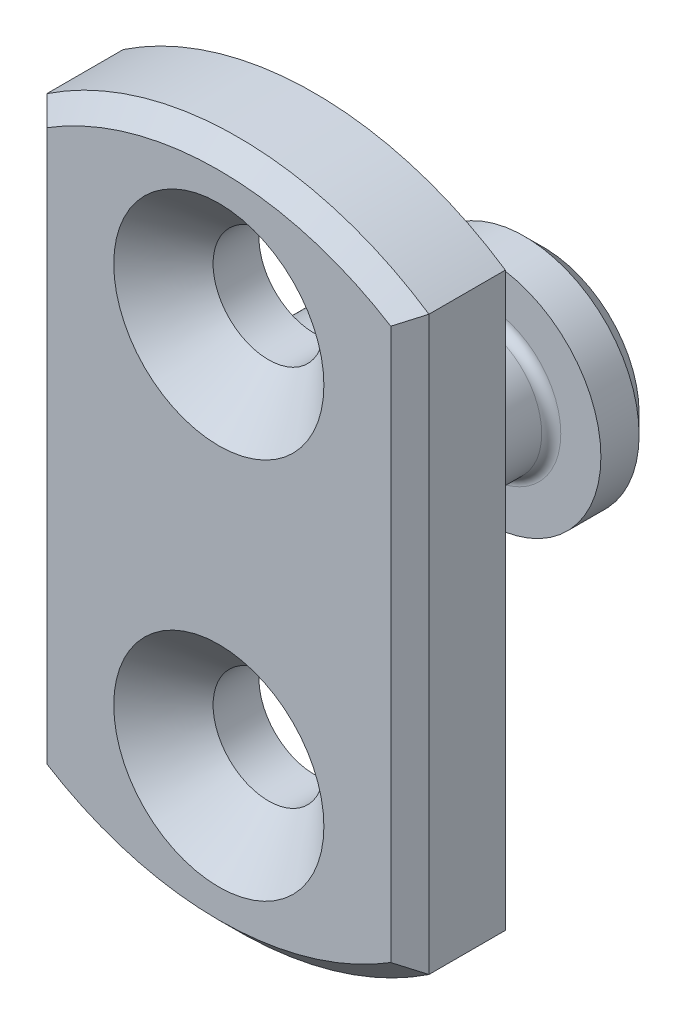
ISO-10303-21;
HEADER;
FILE_DESCRIPTION(('STEP AP214'),'2;1');
FILE_NAME('part.step','',(''),(''),'','','');
FILE_SCHEMA(('AUTOMOTIVE_DESIGN { 1 0 10303 214 1 1 1 1 }'));
ENDSEC;
DATA;
#1=APPLICATION_CONTEXT('core data for automotive mechanical design processes');
#2=APPLICATION_PROTOCOL_DEFINITION('international standard','automotive_design',2000,#1);
#3=PRODUCT_CONTEXT('',#1,'mechanical');
#4=PRODUCT('Part','Part','',(#3));
#5=PRODUCT_RELATED_PRODUCT_CATEGORY('part','',(#4));
#6=PRODUCT_DEFINITION_FORMATION('','',#4);
#7=PRODUCT_DEFINITION_CONTEXT('part definition',#1,'design');
#8=PRODUCT_DEFINITION('design','',#6,#7);
#9=PRODUCT_DEFINITION_SHAPE('','',#8);
#10=(LENGTH_UNIT() NAMED_UNIT(*) SI_UNIT(.MILLI.,.METRE.));
#11=(NAMED_UNIT(*) PLANE_ANGLE_UNIT() SI_UNIT($,.RADIAN.));
#12=(NAMED_UNIT(*) SI_UNIT($,.STERADIAN.) SOLID_ANGLE_UNIT());
#13=UNCERTAINTY_MEASURE_WITH_UNIT(LENGTH_MEASURE(1.E-05),#10,'distance_accuracy_value','');
#14=(GEOMETRIC_REPRESENTATION_CONTEXT(3) GLOBAL_UNCERTAINTY_ASSIGNED_CONTEXT((#13)) GLOBAL_UNIT_ASSIGNED_CONTEXT((#10,
#11,#12)) REPRESENTATION_CONTEXT('',''));
#15=CARTESIAN_POINT('',(0.,0.,0.));
#16=DIRECTION('',(0.,0.,1.));
#17=DIRECTION('',(1.,0.,0.));
#18=AXIS2_PLACEMENT_3D('',#15,#16,#17);
#19=CARTESIAN_POINT('',(0.,0.,8.5));
#20=DIRECTION('',(0.,0.,-1.));
#21=DIRECTION('',(-1.,0.,0.));
#22=AXIS2_PLACEMENT_3D('',#19,#20,#21);
#23=CYLINDRICAL_SURFACE('',#22,9.);
#24=DIRECTION('',(0.,0.,-1.));
#25=VECTOR('',#24,1.);
#26=CARTESIAN_POINT('',(-5.,7.48331477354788,8.5));
#27=LINE('',#26,#25);
#28=CARTESIAN_POINT('',(-5.,7.48331477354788,8.00000000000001));
#29=VERTEX_POINT('',#28);
#30=CARTESIAN_POINT('',(-5.,7.48331477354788,6.));
#31=VERTEX_POINT('',#30);
#32=EDGE_CURVE('E118',#29,#31,#27,.T.);
#33=ORIENTED_EDGE('',*,*,#32,.F.);
#34=CARTESIAN_POINT('',(0.,0.,8.00000000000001));
#35=DIRECTION('',(0.,0.,1.));
#36=DIRECTION('',(1.,0.,0.));
#37=AXIS2_PLACEMENT_3D('',#34,#35,#36);
#38=CIRCLE('',#37,9.);
#39=CARTESIAN_POINT('',(5.,7.48331477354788,8.00000000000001));
#40=VERTEX_POINT('',#39);
#41=EDGE_CURVE('E13',#29,#40,#38,.F.);
#42=ORIENTED_EDGE('',*,*,#41,.T.);
#43=DIRECTION('',(0.,0.,-1.));
#44=VECTOR('',#43,1.);
#45=CARTESIAN_POINT('',(5.,7.48331477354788,8.5));
#46=LINE('',#45,#44);
#47=CARTESIAN_POINT('',(5.,7.48331477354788,6.));
#48=VERTEX_POINT('',#47);
#49=EDGE_CURVE('E148',#40,#48,#46,.T.);
#50=ORIENTED_EDGE('',*,*,#49,.T.);
#51=CARTESIAN_POINT('',(0.,0.,6.));
#52=DIRECTION('',(0.,0.,1.));
#53=DIRECTION('',(1.,0.,0.));
#54=AXIS2_PLACEMENT_3D('',#51,#52,#53);
#55=CIRCLE('',#54,9.);
#56=EDGE_CURVE('E139',#48,#31,#55,.T.);
#57=ORIENTED_EDGE('',*,*,#56,.T.);
#58=EDGE_LOOP('',(#33,#42,#50,#57));
#59=FACE_BOUND('',#58,.T.);
#60=ADVANCED_FACE('F59',(#59),#23,.T.);
#61=DIRECTION('',(0.,0.,-1.));
#62=VECTOR('',#61,1.);
#63=CARTESIAN_POINT('',(5.,-7.48331477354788,8.5));
#64=LINE('',#63,#62);
#65=CARTESIAN_POINT('',(5.,-7.48331477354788,6.));
#66=VERTEX_POINT('',#65);
#67=CARTESIAN_POINT('',(5.,-7.48331477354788,8.00000000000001));
#68=VERTEX_POINT('',#67);
#69=EDGE_CURVE('E303',#66,#68,#64,.F.);
#70=ORIENTED_EDGE('',*,*,#69,.T.);
#71=CARTESIAN_POINT('',(0.,0.,8.00000000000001));
#72=DIRECTION('',(0.,0.,1.));
#73=DIRECTION('',(1.,0.,0.));
#74=AXIS2_PLACEMENT_3D('',#71,#72,#73);
#75=CIRCLE('',#74,9.);
#76=CARTESIAN_POINT('',(-5.,-7.48331477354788,8.00000000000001));
#77=VERTEX_POINT('',#76);
#78=EDGE_CURVE('E133',#68,#77,#75,.F.);
#79=ORIENTED_EDGE('',*,*,#78,.T.);
#80=DIRECTION('',(0.,0.,-1.));
#81=VECTOR('',#80,1.);
#82=CARTESIAN_POINT('',(-5.,-7.48331477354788,8.5));
#83=LINE('',#82,#81);
#84=CARTESIAN_POINT('',(-5.,-7.48331477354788,6.));
#85=VERTEX_POINT('',#84);
#86=EDGE_CURVE('E117',#85,#77,#83,.F.);
#87=ORIENTED_EDGE('',*,*,#86,.F.);
#88=EDGE_CURVE('E131',#85,#66,#55,.T.);
#89=ORIENTED_EDGE('',*,*,#88,.T.);
#90=EDGE_LOOP('',(#70,#79,#87,#89));
#91=FACE_BOUND('',#90,.T.);
#92=ADVANCED_FACE('F130',(#91),#23,.T.);
#93=CARTESIAN_POINT('',(0.,0.,8.5));
#94=DIRECTION('',(0.,0.,1.));
#95=DIRECTION('',(1.,0.,0.));
#96=AXIS2_PLACEMENT_3D('',#93,#94,#95);
#97=PLANE('',#96);
#98=DIRECTION('',(0.,-1.,0.));
#99=VECTOR('',#98,1.);
#100=CARTESIAN_POINT('',(-4.5,0.,8.5));
#101=LINE('',#100,#99);
#102=CARTESIAN_POINT('',(-4.5,7.21110255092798,8.5));
#103=VERTEX_POINT('',#102);
#104=CARTESIAN_POINT('',(-4.5,-7.21110255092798,8.5));
#105=VERTEX_POINT('',#104);
#106=EDGE_CURVE('E182',#103,#105,#101,.T.);
#107=ORIENTED_EDGE('',*,*,#106,.T.);
#108=CARTESIAN_POINT('',(0.,0.,8.5));
#109=DIRECTION('',(0.,0.,1.));
#110=DIRECTION('',(1.,0.,0.));
#111=AXIS2_PLACEMENT_3D('',#108,#109,#110);
#112=CIRCLE('',#111,8.5);
#113=CARTESIAN_POINT('',(4.50000000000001,-7.21110255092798,8.5));
#114=VERTEX_POINT('',#113);
#115=EDGE_CURVE('E186',#105,#114,#112,.T.);
#116=ORIENTED_EDGE('',*,*,#115,.T.);
#117=DIRECTION('',(0.,1.,0.));
#118=VECTOR('',#117,1.);
#119=CARTESIAN_POINT('',(4.5,7.48331477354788,8.5));
#120=LINE('',#119,#118);
#121=CARTESIAN_POINT('',(4.5,7.21110255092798,8.5));
#122=VERTEX_POINT('',#121);
#123=EDGE_CURVE('E184',#114,#122,#120,.T.);
#124=ORIENTED_EDGE('',*,*,#123,.T.);
#125=CARTESIAN_POINT('',(0.,0.,8.5));
#126=DIRECTION('',(0.,0.,1.));
#127=DIRECTION('',(1.,0.,0.));
#128=AXIS2_PLACEMENT_3D('',#125,#126,#127);
#129=CIRCLE('',#128,8.5);
#130=EDGE_CURVE('E172',#122,#103,#129,.T.);
#131=ORIENTED_EDGE('',*,*,#130,.T.);
#132=EDGE_LOOP('',(#107,#116,#124,#131));
#133=FACE_BOUND('',#132,.T.);
#134=CARTESIAN_POINT('',(0.,-5.,8.5));
#135=DIRECTION('',(0.,0.,1.));
#136=DIRECTION('',(1.,0.,0.));
#137=AXIS2_PLACEMENT_3D('',#134,#135,#136);
#138=CIRCLE('',#137,2.75);
#139=CARTESIAN_POINT('',(2.75,-5.,8.5));
#140=VERTEX_POINT('',#139);
#141=EDGE_CURVE('E293',#140,#140,#138,.T.);
#142=ORIENTED_EDGE('',*,*,#141,.F.);
#143=EDGE_LOOP('',(#142));
#144=FACE_BOUND('',#143,.T.);
#145=CARTESIAN_POINT('',(0.,5.,8.5));
#146=DIRECTION('',(0.,0.,1.));
#147=DIRECTION('',(1.,0.,0.));
#148=AXIS2_PLACEMENT_3D('',#145,#146,#147);
#149=CIRCLE('',#148,2.75);
#150=CARTESIAN_POINT('',(2.75,5.,8.5));
#151=VERTEX_POINT('',#150);
#152=EDGE_CURVE('E179',#151,#151,#149,.T.);
#153=ORIENTED_EDGE('',*,*,#152,.F.);
#154=EDGE_LOOP('',(#153));
#155=FACE_BOUND('',#154,.T.);
#156=ADVANCED_FACE('F230',(#133,#144,#155),#97,.T.);
#157=CARTESIAN_POINT('',(0.,0.,6.));
#158=DIRECTION('',(0.,0.,1.));
#159=DIRECTION('',(1.,0.,0.));
#160=AXIS2_PLACEMENT_3D('',#157,#158,#159);
#161=PLANE('',#160);
#162=CARTESIAN_POINT('',(0.,-5.,6.));
#163=DIRECTION('',(0.,0.,1.));
#164=DIRECTION('',(1.,0.,0.));
#165=AXIS2_PLACEMENT_3D('',#162,#163,#164);
#166=CIRCLE('',#165,1.45);
#167=CARTESIAN_POINT('',(1.45,-5.,6.));
#168=VERTEX_POINT('',#167);
#169=EDGE_CURVE('E176',#168,#168,#166,.T.);
#170=ORIENTED_EDGE('',*,*,#169,.T.);
#171=EDGE_LOOP('',(#170));
#172=FACE_BOUND('',#171,.T.);
#173=CARTESIAN_POINT('',(0.,5.,6.));
#174=DIRECTION('',(0.,0.,1.));
#175=DIRECTION('',(1.,0.,0.));
#176=AXIS2_PLACEMENT_3D('',#173,#174,#175);
#177=CIRCLE('',#176,1.45);
#178=CARTESIAN_POINT('',(1.45,5.,6.));
#179=VERTEX_POINT('',#178);
#180=EDGE_CURVE('E134',#179,#179,#177,.T.);
#181=ORIENTED_EDGE('',*,*,#180,.T.);
#182=EDGE_LOOP('',(#181));
#183=FACE_BOUND('',#182,.T.);
#184=CARTESIAN_POINT('',(0.,0.,6.));
#185=DIRECTION('',(0.,0.,1.));
#186=DIRECTION('',(1.,0.,0.));
#187=AXIS2_PLACEMENT_3D('',#184,#185,#186);
#188=CIRCLE('',#187,3.);
#189=CARTESIAN_POINT('',(3.,0.,6.));
#190=VERTEX_POINT('',#189);
#191=EDGE_CURVE('E142',#190,#190,#188,.T.);
#192=ORIENTED_EDGE('',*,*,#191,.T.);
#193=EDGE_LOOP('',(#192));
#194=FACE_BOUND('',#193,.T.);
#195=ORIENTED_EDGE('',*,*,#56,.F.);
#196=DIRECTION('',(0.,-1.,0.));
#197=VECTOR('',#196,1.);
#198=CARTESIAN_POINT('',(5.,0.,6.));
#199=LINE('',#198,#197);
#200=EDGE_CURVE('E123',#48,#66,#199,.T.);
#201=ORIENTED_EDGE('',*,*,#200,.T.);
#202=ORIENTED_EDGE('',*,*,#88,.F.);
#203=DIRECTION('',(0.,-1.,0.));
#204=VECTOR('',#203,1.);
#205=CARTESIAN_POINT('',(-5.,0.,6.));
#206=LINE('',#205,#204);
#207=EDGE_CURVE('E114',#31,#85,#206,.T.);
#208=ORIENTED_EDGE('',*,*,#207,.F.);
#209=EDGE_LOOP('',(#195,#201,#202,#208));
#210=FACE_BOUND('',#209,.T.);
#211=ADVANCED_FACE('F137',(#172,#183,#194,#210),#161,.F.);
#212=CARTESIAN_POINT('',(0.,0.,6.));
#213=DIRECTION('',(0.,0.,-1.));
#214=DIRECTION('',(-1.,0.,0.));
#215=AXIS2_PLACEMENT_3D('',#212,#213,#214);
#216=CYLINDRICAL_SURFACE('',#215,3.);
#217=ORIENTED_EDGE('',*,*,#191,.F.);
#218=EDGE_LOOP('',(#217));
#219=FACE_BOUND('',#218,.T.);
#220=CARTESIAN_POINT('',(0.,0.,4.));
#221=DIRECTION('',(0.,0.,-1.));
#222=DIRECTION('',(-1.,0.,0.));
#223=AXIS2_PLACEMENT_3D('',#220,#221,#222);
#224=CIRCLE('',#223,3.);
#225=CARTESIAN_POINT('',(-3.,0.,4.));
#226=VERTEX_POINT('',#225);
#227=EDGE_CURVE('E140',#226,#226,#224,.T.);
#228=ORIENTED_EDGE('',*,*,#227,.F.);
#229=EDGE_LOOP('',(#228));
#230=FACE_BOUND('',#229,.T.);
#231=ADVANCED_FACE('F240',(#219,#230),#216,.T.);
#232=CARTESIAN_POINT('',(1.7,0.,4.));
#233=DIRECTION('',(0.,0.,-1.));
#234=DIRECTION('',(-1.,0.,0.));
#235=AXIS2_PLACEMENT_3D('',#232,#233,#234);
#236=PLANE('',#235);
#237=CARTESIAN_POINT('',(0.,0.,4.));
#238=DIRECTION('',(0.,0.,-1.));
#239=DIRECTION('',(-1.,0.,0.));
#240=AXIS2_PLACEMENT_3D('',#237,#238,#239);
#241=CIRCLE('',#240,1.95);
#242=CARTESIAN_POINT('',(-1.95,0.,4.));
#243=VERTEX_POINT('',#242);
#244=EDGE_CURVE('E163',#243,#243,#241,.F.);
#245=ORIENTED_EDGE('',*,*,#244,.T.);
#246=EDGE_LOOP('',(#245));
#247=FACE_BOUND('',#246,.T.);
#248=ORIENTED_EDGE('',*,*,#227,.T.);
#249=EDGE_LOOP('',(#248));
#250=FACE_BOUND('',#249,.T.);
#251=ADVANCED_FACE('F243',(#247,#250),#236,.T.);
#252=CARTESIAN_POINT('',(1.7,0.,1.5));
#253=DIRECTION('',(0.,0.,1.));
#254=DIRECTION('',(1.,0.,0.));
#255=AXIS2_PLACEMENT_3D('',#252,#253,#254);
#256=PLANE('',#255);
#257=CARTESIAN_POINT('',(0.,0.,1.5));
#258=DIRECTION('',(0.,0.,1.));
#259=DIRECTION('',(1.,0.,0.));
#260=AXIS2_PLACEMENT_3D('',#257,#258,#259);
#261=CIRCLE('',#260,1.95);
#262=CARTESIAN_POINT('',(1.95,0.,1.5));
#263=VERTEX_POINT('',#262);
#264=EDGE_CURVE('E152',#263,#263,#261,.F.);
#265=ORIENTED_EDGE('',*,*,#264,.T.);
#266=EDGE_LOOP('',(#265));
#267=FACE_BOUND('',#266,.T.);
#268=CARTESIAN_POINT('',(0.,0.,1.5));
#269=DIRECTION('',(0.,0.,1.));
#270=DIRECTION('',(1.,0.,0.));
#271=AXIS2_PLACEMENT_3D('',#268,#269,#270);
#272=CIRCLE('',#271,3.);
#273=CARTESIAN_POINT('',(3.,0.,1.5));
#274=VERTEX_POINT('',#273);
#275=EDGE_CURVE('E144',#274,#274,#272,.T.);
#276=ORIENTED_EDGE('',*,*,#275,.T.);
#277=EDGE_LOOP('',(#276));
#278=FACE_BOUND('',#277,.T.);
#279=ADVANCED_FACE('F268',(#267,#278),#256,.T.);
#280=CARTESIAN_POINT('',(0.,0.,-0.389556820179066));
#281=DIRECTION('',(0.,0.,-1.));
#282=DIRECTION('',(-1.,0.,0.));
#283=AXIS2_PLACEMENT_3D('',#280,#281,#282);
#284=CYLINDRICAL_SURFACE('',#283,1.7);
#285=CARTESIAN_POINT('',(0.,0.,1.75));
#286=DIRECTION('',(0.,0.,1.));
#287=DIRECTION('',(1.,0.,0.));
#288=AXIS2_PLACEMENT_3D('',#285,#286,#287);
#289=CIRCLE('',#288,1.7);
#290=CARTESIAN_POINT('',(1.7,0.,1.75));
#291=VERTEX_POINT('',#290);
#292=EDGE_CURVE('E160',#291,#291,#289,.T.);
#293=ORIENTED_EDGE('',*,*,#292,.T.);
#294=EDGE_LOOP('',(#293));
#295=FACE_BOUND('',#294,.T.);
#296=CARTESIAN_POINT('',(0.,0.,3.75));
#297=DIRECTION('',(0.,0.,-1.));
#298=DIRECTION('',(-1.,0.,0.));
#299=AXIS2_PLACEMENT_3D('',#296,#297,#298);
#300=CIRCLE('',#299,1.7);
#301=CARTESIAN_POINT('',(-1.7,0.,3.75));
#302=VERTEX_POINT('',#301);
#303=EDGE_CURVE('E157',#302,#302,#300,.T.);
#304=ORIENTED_EDGE('',*,*,#303,.T.);
#305=EDGE_LOOP('',(#304));
#306=FACE_BOUND('',#305,.T.);
#307=ADVANCED_FACE('F238',(#295,#306),#284,.T.);
#308=CARTESIAN_POINT('',(0.,0.,0.));
#309=DIRECTION('',(0.,0.,1.));
#310=DIRECTION('',(1.,0.,0.));
#311=AXIS2_PLACEMENT_3D('',#308,#309,#310);
#312=PLANE('',#311);
#313=CARTESIAN_POINT('',(0.,0.,0.));
#314=DIRECTION('',(0.,0.,1.));
#315=DIRECTION('',(1.,0.,0.));
#316=AXIS2_PLACEMENT_3D('',#313,#314,#315);
#317=CIRCLE('',#316,2.5);
#318=CARTESIAN_POINT('',(2.5,0.,0.));
#319=VERTEX_POINT('',#318);
#320=EDGE_CURVE('E124',#319,#319,#317,.F.);
#321=ORIENTED_EDGE('',*,*,#320,.T.);
#322=EDGE_LOOP('',(#321));
#323=FACE_BOUND('',#322,.T.);
#324=ADVANCED_FACE('F234',(#323),#312,.F.);
#325=CARTESIAN_POINT('',(0.,0.,0.500000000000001));
#326=DIRECTION('',(0.,0.,1.));
#327=DIRECTION('',(1.,0.,0.));
#328=AXIS2_PLACEMENT_3D('',#325,#326,#327);
#329=CIRCLE('',#328,3.);
#330=CARTESIAN_POINT('',(3.,0.,0.500000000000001));
#331=VERTEX_POINT('',#330);
#332=EDGE_CURVE('E166',#331,#331,#329,.T.);
#333=ORIENTED_EDGE('',*,*,#332,.T.);
#334=EDGE_LOOP('',(#333));
#335=FACE_BOUND('',#334,.T.);
#336=ORIENTED_EDGE('',*,*,#275,.F.);
#337=EDGE_LOOP('',(#336));
#338=FACE_BOUND('',#337,.T.);
#339=ADVANCED_FACE('F237',(#335,#338),#216,.T.);
#340=CARTESIAN_POINT('',(0.,0.,1.75));
#341=DIRECTION('',(0.,0.,1.));
#342=DIRECTION('',(1.,0.,0.));
#343=AXIS2_PLACEMENT_3D('',#340,#341,#342);
#344=TOROIDAL_SURFACE('',#343,1.95,0.25);
#345=ORIENTED_EDGE('',*,*,#292,.F.);
#346=EDGE_LOOP('',(#345));
#347=FACE_BOUND('',#346,.T.);
#348=ORIENTED_EDGE('',*,*,#264,.F.);
#349=EDGE_LOOP('',(#348));
#350=FACE_BOUND('',#349,.T.);
#351=ADVANCED_FACE('F245',(#347,#350),#344,.F.);
#352=CARTESIAN_POINT('',(0.,0.,3.75));
#353=DIRECTION('',(0.,0.,-1.));
#354=DIRECTION('',(-1.,0.,0.));
#355=AXIS2_PLACEMENT_3D('',#352,#353,#354);
#356=TOROIDAL_SURFACE('',#355,1.95,0.25);
#357=ORIENTED_EDGE('',*,*,#244,.F.);
#358=EDGE_LOOP('',(#357));
#359=FACE_BOUND('',#358,.T.);
#360=ORIENTED_EDGE('',*,*,#303,.F.);
#361=EDGE_LOOP('',(#360));
#362=FACE_BOUND('',#361,.T.);
#363=ADVANCED_FACE('F248',(#359,#362),#356,.F.);
#364=CARTESIAN_POINT('',(0.,0.,0.500000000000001));
#365=DIRECTION('',(0.,0.,1.));
#366=DIRECTION('',(1.,0.,0.));
#367=AXIS2_PLACEMENT_3D('',#364,#365,#366);
#368=CONICAL_SURFACE('',#367,3.,0.785398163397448);
#369=ORIENTED_EDGE('',*,*,#320,.F.);
#370=EDGE_LOOP('',(#369));
#371=FACE_BOUND('',#370,.T.);
#372=ORIENTED_EDGE('',*,*,#332,.F.);
#373=EDGE_LOOP('',(#372));
#374=FACE_BOUND('',#373,.T.);
#375=ADVANCED_FACE('F251',(#371,#374),#368,.T.);
#376=CARTESIAN_POINT('',(-5.,13.7579719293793,0.));
#377=DIRECTION('',(-1.,0.,0.));
#378=DIRECTION('',(0.,-1.,0.));
#379=AXIS2_PLACEMENT_3D('',#376,#377,#378);
#380=PLANE('',#379);
#381=ORIENTED_EDGE('',*,*,#86,.T.);
#382=DIRECTION('',(0.,1.,0.));
#383=VECTOR('',#382,1.);
#384=CARTESIAN_POINT('',(-5.,13.7579719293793,8.00000000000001));
#385=LINE('',#384,#383);
#386=EDGE_CURVE('E72',#77,#29,#385,.T.);
#387=ORIENTED_EDGE('',*,*,#386,.T.);
#388=ORIENTED_EDGE('',*,*,#32,.T.);
#389=ORIENTED_EDGE('',*,*,#207,.T.);
#390=EDGE_LOOP('',(#381,#387,#388,#389));
#391=FACE_BOUND('',#390,.T.);
#392=ADVANCED_FACE('F116',(#391),#380,.T.);
#393=CARTESIAN_POINT('',(5.,13.7579719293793,0.));
#394=DIRECTION('',(-1.,0.,0.));
#395=DIRECTION('',(0.,-1.,0.));
#396=AXIS2_PLACEMENT_3D('',#393,#394,#395);
#397=PLANE('',#396);
#398=ORIENTED_EDGE('',*,*,#49,.F.);
#399=DIRECTION('',(0.,-1.,0.));
#400=VECTOR('',#399,1.);
#401=CARTESIAN_POINT('',(5.,-7.48331477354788,8.00000000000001));
#402=LINE('',#401,#400);
#403=EDGE_CURVE('E190',#40,#68,#402,.T.);
#404=ORIENTED_EDGE('',*,*,#403,.T.);
#405=ORIENTED_EDGE('',*,*,#69,.F.);
#406=ORIENTED_EDGE('',*,*,#200,.F.);
#407=EDGE_LOOP('',(#398,#404,#405,#406));
#408=FACE_BOUND('',#407,.T.);
#409=ADVANCED_FACE('F258',(#408),#397,.F.);
#410=CARTESIAN_POINT('',(0.,5.,8.5));
#411=DIRECTION('',(0.,0.,1.));
#412=DIRECTION('',(1.,0.,0.));
#413=AXIS2_PLACEMENT_3D('',#410,#411,#412);
#414=CYLINDRICAL_SURFACE('',#413,1.45);
#415=CARTESIAN_POINT('',(0.,5.,7.2));
#416=DIRECTION('',(0.,0.,1.));
#417=DIRECTION('',(1.,0.,0.));
#418=AXIS2_PLACEMENT_3D('',#415,#416,#417);
#419=CIRCLE('',#418,1.45);
#420=CARTESIAN_POINT('',(1.45,5.,7.2));
#421=VERTEX_POINT('',#420);
#422=EDGE_CURVE('E175',#421,#421,#419,.T.);
#423=ORIENTED_EDGE('',*,*,#422,.T.);
#424=EDGE_LOOP('',(#423));
#425=FACE_BOUND('',#424,.T.);
#426=ORIENTED_EDGE('',*,*,#180,.F.);
#427=EDGE_LOOP('',(#426));
#428=FACE_BOUND('',#427,.T.);
#429=ADVANCED_FACE('F334',(#425,#428),#414,.F.);
#430=CARTESIAN_POINT('',(0.,5.,8.5));
#431=DIRECTION('',(0.,0.,1.));
#432=DIRECTION('',(1.,0.,0.));
#433=AXIS2_PLACEMENT_3D('',#430,#431,#432);
#434=CONICAL_SURFACE('',#433,2.75,0.785398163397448);
#435=ORIENTED_EDGE('',*,*,#422,.F.);
#436=EDGE_LOOP('',(#435));
#437=FACE_BOUND('',#436,.T.);
#438=ORIENTED_EDGE('',*,*,#152,.T.);
#439=EDGE_LOOP('',(#438));
#440=FACE_BOUND('',#439,.T.);
#441=ADVANCED_FACE('F329',(#437,#440),#434,.F.);
#442=CARTESIAN_POINT('',(0.,-5.,8.5));
#443=DIRECTION('',(0.,0.,1.));
#444=DIRECTION('',(1.,0.,0.));
#445=AXIS2_PLACEMENT_3D('',#442,#443,#444);
#446=CYLINDRICAL_SURFACE('',#445,1.45);
#447=CARTESIAN_POINT('',(0.,-5.,7.2));
#448=DIRECTION('',(0.,0.,1.));
#449=DIRECTION('',(1.,0.,0.));
#450=AXIS2_PLACEMENT_3D('',#447,#448,#449);
#451=CIRCLE('',#450,1.45);
#452=CARTESIAN_POINT('',(1.45,-5.,7.2));
#453=VERTEX_POINT('',#452);
#454=EDGE_CURVE('E180',#453,#453,#451,.T.);
#455=ORIENTED_EDGE('',*,*,#454,.T.);
#456=EDGE_LOOP('',(#455));
#457=FACE_BOUND('',#456,.T.);
#458=ORIENTED_EDGE('',*,*,#169,.F.);
#459=EDGE_LOOP('',(#458));
#460=FACE_BOUND('',#459,.T.);
#461=ADVANCED_FACE('F321',(#457,#460),#446,.F.);
#462=CARTESIAN_POINT('',(0.,-5.,8.5));
#463=DIRECTION('',(0.,0.,1.));
#464=DIRECTION('',(1.,0.,0.));
#465=AXIS2_PLACEMENT_3D('',#462,#463,#464);
#466=CONICAL_SURFACE('',#465,2.75,0.785398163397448);
#467=ORIENTED_EDGE('',*,*,#454,.F.);
#468=EDGE_LOOP('',(#467));
#469=FACE_BOUND('',#468,.T.);
#470=ORIENTED_EDGE('',*,*,#141,.T.);
#471=EDGE_LOOP('',(#470));
#472=FACE_BOUND('',#471,.T.);
#473=ADVANCED_FACE('F222',(#469,#472),#466,.F.);
#474=CARTESIAN_POINT('',(0.,0.,8.5));
#475=DIRECTION('',(0.,0.,-1.));
#476=DIRECTION('',(-1.,0.,0.));
#477=AXIS2_PLACEMENT_3D('',#474,#475,#476);
#478=CONICAL_SURFACE('',#477,8.5,0.785398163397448);
#479=CARTESIAN_POINT('',(4.5,7.21110255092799,8.5));
#480=CARTESIAN_POINT('',(4.58313411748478,7.25720319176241,8.41686588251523));
#481=CARTESIAN_POINT('',(4.66636785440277,7.30293787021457,8.33363214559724));
#482=CARTESIAN_POINT('',(4.83303452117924,7.39367527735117,8.16696547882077));
#483=CARTESIAN_POINT('',(4.91646745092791,7.43867800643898,8.0835325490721));
#484=CARTESIAN_POINT('',(4.99999999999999,7.4833147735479,8.00000000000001));
#485=B_SPLINE_CURVE_WITH_KNOTS('',3,(#479,#480,#481,#482,#483,#484),.UNSPECIFIED.,.F.,.F.,(4,2,
4),(0.,0.37884869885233,0.757697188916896),.UNSPECIFIED.);
#486=EDGE_CURVE('E310',#40,#122,#485,.F.);
#487=ORIENTED_EDGE('',*,*,#486,.F.);
#488=ORIENTED_EDGE('',*,*,#41,.F.);
#489=CARTESIAN_POINT('',(-5.,7.48331477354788,8.00000000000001));
#490=CARTESIAN_POINT('',(-4.91646745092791,7.43867800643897,8.08353254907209));
#491=CARTESIAN_POINT('',(-4.83303452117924,7.39367527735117,8.16696547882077));
#492=CARTESIAN_POINT('',(-4.66636785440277,7.30293787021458,8.33363214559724));
#493=CARTESIAN_POINT('',(-4.58313411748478,7.25720319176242,8.41686588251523));
#494=CARTESIAN_POINT('',(-4.5,7.211102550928,8.5));
#495=B_SPLINE_CURVE_WITH_KNOTS('',3,(#489,#490,#491,#492,#493,#494),.UNSPECIFIED.,.F.,.F.,(4,2,
4),(0.,0.378848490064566,0.757697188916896),.UNSPECIFIED.);
#496=EDGE_CURVE('E64',#103,#29,#495,.F.);
#497=ORIENTED_EDGE('',*,*,#496,.F.);
#498=ORIENTED_EDGE('',*,*,#130,.F.);
#499=EDGE_LOOP('',(#487,#488,#497,#498));
#500=FACE_BOUND('',#499,.T.);
#501=ADVANCED_FACE('F61',(#500),#478,.T.);
#502=CARTESIAN_POINT('',(-4.5,0.,8.5));
#503=DIRECTION('',(0.707106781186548,0.,-0.707106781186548));
#504=DIRECTION('',(0.,-1.,0.));
#505=AXIS2_PLACEMENT_3D('',#502,#503,#504);
#506=PLANE('',#505);
#507=ORIENTED_EDGE('',*,*,#496,.T.);
#508=ORIENTED_EDGE('',*,*,#386,.F.);
#509=CARTESIAN_POINT('',(-5.,-7.48331477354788,8.00000000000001));
#510=CARTESIAN_POINT('',(-4.91646745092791,-7.43867800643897,8.08353254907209));
#511=CARTESIAN_POINT('',(-4.83303452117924,-7.39367527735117,8.16696547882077));
#512=CARTESIAN_POINT('',(-4.66636785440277,-7.30293787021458,8.33363214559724));
#513=CARTESIAN_POINT('',(-4.58313411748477,-7.25720319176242,8.41686588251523));
#514=CARTESIAN_POINT('',(-4.5,-7.211102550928,8.50000000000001));
#515=B_SPLINE_CURVE_WITH_KNOTS('',3,(#509,#510,#511,#512,#513,#514),.UNSPECIFIED.,.F.,.F.,(4,2,
4),(0.,0.378848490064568,0.7576971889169),.UNSPECIFIED.);
#516=EDGE_CURVE('E200',#105,#77,#515,.F.);
#517=ORIENTED_EDGE('',*,*,#516,.F.);
#518=ORIENTED_EDGE('',*,*,#106,.F.);
#519=EDGE_LOOP('',(#507,#508,#517,#518));
#520=FACE_BOUND('',#519,.T.);
#521=ADVANCED_FACE('F211',(#520),#506,.F.);
#522=CARTESIAN_POINT('',(5.,13.7579719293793,8.00000000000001));
#523=DIRECTION('',(0.707106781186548,0.,0.707106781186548));
#524=DIRECTION('',(0.,1.,0.));
#525=AXIS2_PLACEMENT_3D('',#522,#523,#524);
#526=PLANE('',#525);
#527=ORIENTED_EDGE('',*,*,#486,.T.);
#528=ORIENTED_EDGE('',*,*,#123,.F.);
#529=CARTESIAN_POINT('',(4.5,-7.21110255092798,8.5));
#530=CARTESIAN_POINT('',(4.58313411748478,-7.25720319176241,8.41686588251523));
#531=CARTESIAN_POINT('',(4.66636785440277,-7.30293787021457,8.33363214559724));
#532=CARTESIAN_POINT('',(4.83303452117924,-7.39367527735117,8.16696547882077));
#533=CARTESIAN_POINT('',(4.91646745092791,-7.43867800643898,8.0835325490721));
#534=CARTESIAN_POINT('',(5.,-7.4833147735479,8.00000000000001));
#535=B_SPLINE_CURVE_WITH_KNOTS('',3,(#529,#530,#531,#532,#533,#534),.UNSPECIFIED.,.F.,.F.,(4,2,
4),(0.,0.378848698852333,0.757697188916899),.UNSPECIFIED.);
#536=EDGE_CURVE('E193',#68,#114,#535,.F.);
#537=ORIENTED_EDGE('',*,*,#536,.F.);
#538=ORIENTED_EDGE('',*,*,#403,.F.);
#539=EDGE_LOOP('',(#527,#528,#537,#538));
#540=FACE_BOUND('',#539,.T.);
#541=ADVANCED_FACE('F204',(#540),#526,.T.);
#542=CARTESIAN_POINT('',(0.,0.,8.5));
#543=DIRECTION('',(0.,0.,-1.));
#544=DIRECTION('',(-1.,0.,0.));
#545=AXIS2_PLACEMENT_3D('',#542,#543,#544);
#546=CONICAL_SURFACE('',#545,8.5,0.785398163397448);
#547=ORIENTED_EDGE('',*,*,#516,.T.);
#548=ORIENTED_EDGE('',*,*,#78,.F.);
#549=ORIENTED_EDGE('',*,*,#536,.T.);
#550=ORIENTED_EDGE('',*,*,#115,.F.);
#551=EDGE_LOOP('',(#547,#548,#549,#550));
#552=FACE_BOUND('',#551,.T.);
#553=ADVANCED_FACE('F207',(#552),#546,.T.);
#554=CLOSED_SHELL('',(#60,#92,#156,#211,#231,#251,#279,#307,#324,#339,#351,#363,#375,#392,#409,
#429,#441,#461,#473,#501,#521,#541,#553));
#555=MANIFOLD_SOLID_BREP('B2',#554);
#556=ADVANCED_BREP_SHAPE_REPRESENTATION('',(#18,#555),#14);
#557=SHAPE_DEFINITION_REPRESENTATION(#9,#556);
ENDSEC;
END-ISO-10303-21;
